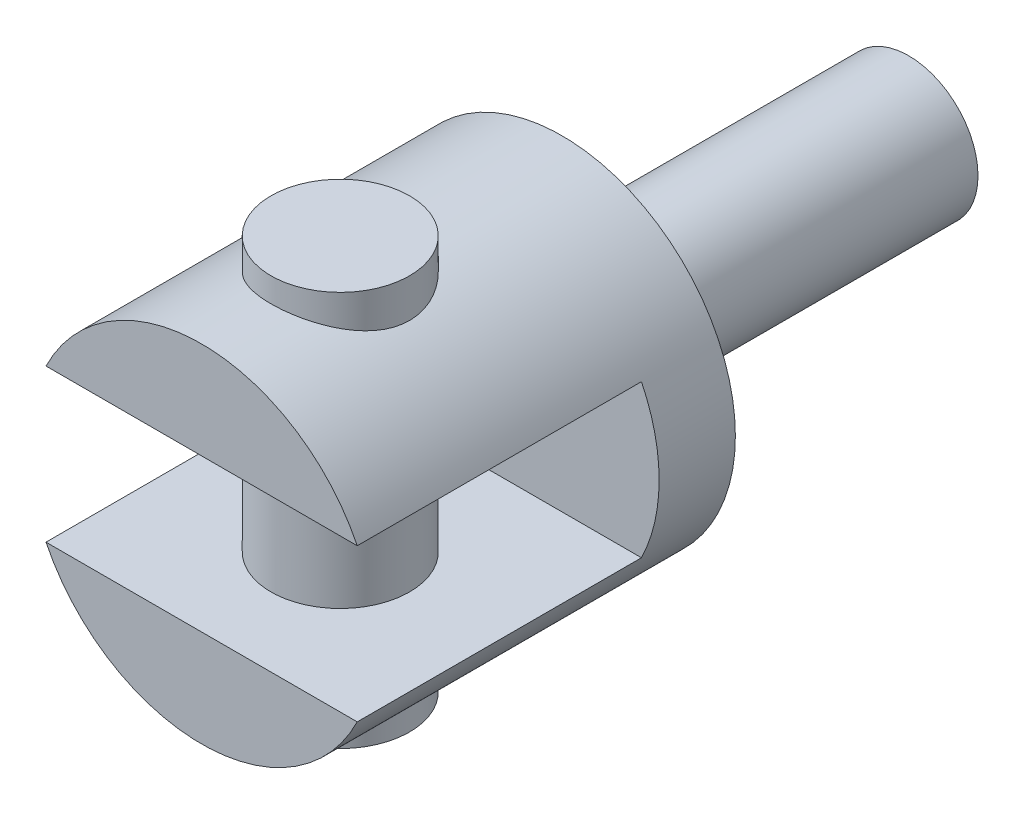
ISO-10303-21;
HEADER;
FILE_DESCRIPTION(('STEP AP214'),'2;1');
FILE_NAME('part.step','',(''),(''),'','','');
FILE_SCHEMA(('AUTOMOTIVE_DESIGN { 1 0 10303 214 1 1 1 1 }'));
ENDSEC;
DATA;
#1=APPLICATION_CONTEXT('core data for automotive mechanical design processes');
#2=APPLICATION_PROTOCOL_DEFINITION('international standard','automotive_design',2000,#1);
#3=PRODUCT_CONTEXT('',#1,'mechanical');
#4=PRODUCT('Part','Part','',(#3));
#5=PRODUCT_RELATED_PRODUCT_CATEGORY('part','',(#4));
#6=PRODUCT_DEFINITION_FORMATION('','',#4);
#7=PRODUCT_DEFINITION_CONTEXT('part definition',#1,'design');
#8=PRODUCT_DEFINITION('design','',#6,#7);
#9=PRODUCT_DEFINITION_SHAPE('','',#8);
#10=(LENGTH_UNIT() NAMED_UNIT(*) SI_UNIT(.MILLI.,.METRE.));
#11=(NAMED_UNIT(*) PLANE_ANGLE_UNIT() SI_UNIT($,.RADIAN.));
#12=(NAMED_UNIT(*) SI_UNIT($,.STERADIAN.) SOLID_ANGLE_UNIT());
#13=UNCERTAINTY_MEASURE_WITH_UNIT(LENGTH_MEASURE(1.E-05),#10,'distance_accuracy_value','');
#14=(GEOMETRIC_REPRESENTATION_CONTEXT(3) GLOBAL_UNCERTAINTY_ASSIGNED_CONTEXT((#13)) GLOBAL_UNIT_ASSIGNED_CONTEXT((#10,
#11,#12)) REPRESENTATION_CONTEXT('',''));
#15=CARTESIAN_POINT('',(0.,0.,0.));
#16=DIRECTION('',(0.,0.,1.));
#17=DIRECTION('',(1.,0.,0.));
#18=AXIS2_PLACEMENT_3D('',#15,#16,#17);
#19=CARTESIAN_POINT('',(0.,0.,52.));
#20=DIRECTION('',(0.,0.,1.));
#21=DIRECTION('',(1.,0.,0.));
#22=AXIS2_PLACEMENT_3D('',#19,#20,#21);
#23=PLANE('',#22);
#24=DIRECTION('',(1.,0.,0.));
#25=VECTOR('',#24,1.);
#26=CARTESIAN_POINT('',(0.,-11.,52.));
#27=LINE('',#26,#25);
#28=CARTESIAN_POINT('',(-22.4499443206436,-11.,52.));
#29=VERTEX_POINT('',#28);
#30=CARTESIAN_POINT('',(22.4499443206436,-11.,52.));
#31=VERTEX_POINT('',#30);
#32=EDGE_CURVE('E39',#29,#31,#27,.T.);
#33=ORIENTED_EDGE('',*,*,#32,.F.);
#34=CARTESIAN_POINT('',(0.,0.,52.));
#35=DIRECTION('',(0.,0.,1.));
#36=DIRECTION('',(1.,0.,0.));
#37=AXIS2_PLACEMENT_3D('',#34,#35,#36);
#38=CIRCLE('',#37,25.);
#39=EDGE_CURVE('E83',#29,#31,#38,.T.);
#40=ORIENTED_EDGE('',*,*,#39,.T.);
#41=EDGE_LOOP('',(#33,#40));
#42=FACE_BOUND('',#41,.T.);
#43=ADVANCED_FACE('F14',(#42),#23,.T.);
#44=DIRECTION('',(-1.,0.,0.));
#45=VECTOR('',#44,1.);
#46=CARTESIAN_POINT('',(0.,11.,52.));
#47=LINE('',#46,#45);
#48=CARTESIAN_POINT('',(22.4499443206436,11.,52.));
#49=VERTEX_POINT('',#48);
#50=CARTESIAN_POINT('',(-22.4499443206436,11.,52.));
#51=VERTEX_POINT('',#50);
#52=EDGE_CURVE('E59',#49,#51,#47,.T.);
#53=ORIENTED_EDGE('',*,*,#52,.F.);
#54=EDGE_CURVE('E81',#49,#51,#38,.T.);
#55=ORIENTED_EDGE('',*,*,#54,.T.);
#56=EDGE_LOOP('',(#53,#55));
#57=FACE_BOUND('',#56,.T.);
#58=ADVANCED_FACE('F16',(#57),#23,.T.);
#59=CARTESIAN_POINT('',(0.,0.,30.));
#60=DIRECTION('',(0.,0.,1.));
#61=DIRECTION('',(1.,0.,0.));
#62=AXIS2_PLACEMENT_3D('',#59,#60,#61);
#63=CYLINDRICAL_SURFACE('',#62,25.);
#64=CARTESIAN_POINT('',(0.,25.,22.));
#65=CARTESIAN_POINT('',(-0.268856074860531,24.9999987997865,22.0000015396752));
#66=CARTESIAN_POINT('',(-0.537815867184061,24.9956509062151,22.0108574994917));
#67=CARTESIAN_POINT('',(-1.07383269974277,24.9783682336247,22.0541835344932));
#68=CARTESIAN_POINT('',(-1.3408883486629,24.9654277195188,22.086668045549));
#69=CARTESIAN_POINT('',(-1.87162915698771,24.9312628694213,22.1730246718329));
#70=CARTESIAN_POINT('',(-2.13530505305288,24.9100193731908,22.2269462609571));
#71=CARTESIAN_POINT('',(-2.6567730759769,24.8598107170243,22.355639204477));
#72=CARTESIAN_POINT('',(-2.91456479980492,24.8308450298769,22.4304119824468));
#73=CARTESIAN_POINT('',(-3.42166104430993,24.7660524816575,22.5998161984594));
#74=CARTESIAN_POINT('',(-3.67099125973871,24.7302490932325,22.6943798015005));
#75=CARTESIAN_POINT('',(-4.16052228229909,24.6526163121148,22.9027020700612));
#76=CARTESIAN_POINT('',(-4.40072273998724,24.6107866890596,23.0164614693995));
#77=CARTESIAN_POINT('',(-4.87046113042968,24.5221467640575,23.2622194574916));
#78=CARTESIAN_POINT('',(-5.10000543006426,24.4753394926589,23.3942069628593));
#79=CARTESIAN_POINT('',(-5.54736801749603,24.3778429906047,23.6755408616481));
#80=CARTESIAN_POINT('',(-5.76518197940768,24.3271523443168,23.8248935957));
#81=CARTESIAN_POINT('',(-6.41724383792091,24.1665964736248,24.3109983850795));
#82=CARTESIAN_POINT('',(-6.83020129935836,24.0521426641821,24.6754141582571));
#83=CARTESIAN_POINT('',(-7.59098514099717,23.8230010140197,25.4671191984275));
#84=CARTESIAN_POINT('',(-7.93877965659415,23.7083130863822,25.8944390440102));
#85=CARTESIAN_POINT('',(-8.41206275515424,23.5428728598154,26.585207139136));
#86=CARTESIAN_POINT('',(-8.5644417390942,23.4877248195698,26.8295584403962));
#87=CARTESIAN_POINT('',(-8.84793241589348,23.3824066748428,27.331273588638));
#88=CARTESIAN_POINT('',(-8.97905285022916,23.3322345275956,27.5886320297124));
#89=CARTESIAN_POINT('',(-9.21889182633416,23.2385160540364,28.1146933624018));
#90=CARTESIAN_POINT('',(-9.32761371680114,23.194968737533,28.3833945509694));
#91=CARTESIAN_POINT('',(-9.52161114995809,23.1160096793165,28.9302969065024));
#92=CARTESIAN_POINT('',(-9.60688828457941,23.0805973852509,29.2084974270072));
#93=CARTESIAN_POINT('',(-9.74973528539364,23.0206079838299,29.7594753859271));
#94=CARTESIAN_POINT('',(-9.80838572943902,22.9956125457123,30.0319271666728));
#95=CARTESIAN_POINT('',(-9.90280197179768,22.9551119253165,30.5814699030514));
#96=CARTESIAN_POINT('',(-9.93856842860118,22.9396064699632,30.8585607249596));
#97=CARTESIAN_POINT('',(-9.98677972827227,22.9186588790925,31.4150265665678));
#98=CARTESIAN_POINT('',(-9.99923443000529,22.9132124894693,31.6944005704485));
#99=CARTESIAN_POINT('',(-10.0006969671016,22.9125744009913,32.2532151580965));
#100=CARTESIAN_POINT('',(-9.98970589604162,22.9173822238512,32.5326557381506));
#101=CARTESIAN_POINT('',(-9.94600313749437,22.9363800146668,33.0698060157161));
#102=CARTESIAN_POINT('',(-9.91486313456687,22.9498908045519,33.327669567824));
#103=CARTESIAN_POINT('',(-9.8327336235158,22.9851984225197,33.8397303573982));
#104=CARTESIAN_POINT('',(-9.781737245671,23.0069981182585,34.0939262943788));
#105=CARTESIAN_POINT('',(-9.66041020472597,23.0582046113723,34.5967988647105));
#106=CARTESIAN_POINT('',(-9.59008442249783,23.0876094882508,34.8454768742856));
#107=CARTESIAN_POINT('',(-9.43069714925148,23.1531719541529,35.3359362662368));
#108=CARTESIAN_POINT('',(-9.34162833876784,23.1893321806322,35.5777149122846));
#109=CARTESIAN_POINT('',(-9.14353943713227,23.2681599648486,36.057636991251));
#110=CARTESIAN_POINT('',(-9.03415671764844,23.3109429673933,36.2956116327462));
#111=CARTESIAN_POINT('',(-8.79745135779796,23.4013011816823,36.7616370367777));
#112=CARTESIAN_POINT('',(-8.67012091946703,23.4488784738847,36.9896834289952));
#113=CARTESIAN_POINT('',(-8.39840118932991,23.5475634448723,37.434593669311));
#114=CARTESIAN_POINT('',(-8.25401043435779,23.5986714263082,37.6514565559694));
#115=CARTESIAN_POINT('',(-7.94904534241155,23.7031359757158,38.0729190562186));
#116=CARTESIAN_POINT('',(-7.78847017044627,23.7564926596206,38.277518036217));
#117=CARTESIAN_POINT('',(-7.43895922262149,23.8683493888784,38.6888152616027));
#118=CARTESIAN_POINT('',(-7.24878974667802,23.9269273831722,38.8944455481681));
#119=CARTESIAN_POINT('',(-6.85187633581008,24.0435970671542,39.2890383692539));
#120=CARTESIAN_POINT('',(-6.64513775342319,24.1016889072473,39.4780062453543));
#121=CARTESIAN_POINT('',(-6.21608047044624,24.2158965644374,39.8382944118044));
#122=CARTESIAN_POINT('',(-5.99375264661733,24.2720111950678,40.0096042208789));
#123=CARTESIAN_POINT('',(-5.53499341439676,24.3807175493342,40.3332233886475));
#124=CARTESIAN_POINT('',(-5.29856771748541,24.4333106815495,40.4855403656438));
#125=CARTESIAN_POINT('',(-4.80805882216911,24.5345984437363,40.7729685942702));
#126=CARTESIAN_POINT('',(-4.55371661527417,24.5831937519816,40.9076735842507));
#127=CARTESIAN_POINT('',(-4.03339771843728,24.6739018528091,41.1550357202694));
#128=CARTESIAN_POINT('',(-3.76742076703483,24.7160144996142,41.267692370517));
#129=CARTESIAN_POINT('',(-3.22583634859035,24.7925136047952,41.4698196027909));
#130=CARTESIAN_POINT('',(-2.95023288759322,24.8269032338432,41.5592997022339));
#131=CARTESIAN_POINT('',(-2.39141303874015,24.8869461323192,41.7141747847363));
#132=CARTESIAN_POINT('',(-2.10819717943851,24.912600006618,41.7795714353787));
#133=CARTESIAN_POINT('',(-1.55340742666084,24.9531491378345,41.8823955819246));
#134=CARTESIAN_POINT('',(-1.28213731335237,24.9685915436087,41.9212500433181));
#135=CARTESIAN_POINT('',(-0.736968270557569,24.9906239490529,41.9765692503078));
#136=CARTESIAN_POINT('',(-0.463069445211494,24.9972142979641,41.9930348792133));
#137=CARTESIAN_POINT('',(0.0851598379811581,25.0013575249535,42.0033944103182));
#138=CARTESIAN_POINT('',(0.359490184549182,24.9989124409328,41.9972934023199));
#139=CARTESIAN_POINT('',(0.906492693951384,24.9850578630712,41.9625985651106));
#140=CARTESIAN_POINT('',(1.17916488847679,24.9736485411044,41.9340051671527));
#141=CARTESIAN_POINT('',(1.70854732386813,24.9428944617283,41.8564286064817));
#142=CARTESIAN_POINT('',(1.96542355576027,24.923930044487,41.8084212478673));
#143=CARTESIAN_POINT('',(2.47400175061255,24.8785950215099,41.6926429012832));
#144=CARTESIAN_POINT('',(2.72570390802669,24.8522246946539,41.6248726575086));
#145=CARTESIAN_POINT('',(3.22229813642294,24.7927274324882,41.4701861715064));
#146=CARTESIAN_POINT('',(3.46719085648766,24.7596011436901,41.3832717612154));
#147=CARTESIAN_POINT('',(3.9488064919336,24.6873702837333,41.1909841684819));
#148=CARTESIAN_POINT('',(4.18552624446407,24.6482634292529,41.085603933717));
#149=CARTESIAN_POINT('',(4.65637431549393,24.5637355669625,40.8537621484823));
#150=CARTESIAN_POINT('',(4.89020861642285,24.5181595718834,40.7267601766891));
#151=CARTESIAN_POINT('',(5.34646626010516,24.4227281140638,40.4549302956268));
#152=CARTESIAN_POINT('',(5.5688853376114,24.3728710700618,40.3100957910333));
#153=CARTESIAN_POINT('',(6.00108282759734,24.2700712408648,40.0035744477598));
#154=CARTESIAN_POINT('',(6.21085927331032,24.2171279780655,39.8418849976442));
#155=CARTESIAN_POINT('',(6.61666901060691,24.1094125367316,39.5026423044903));
#156=CARTESIAN_POINT('',(6.81270170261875,24.0546402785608,39.3250883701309));
#157=CARTESIAN_POINT('',(7.20254295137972,23.9409125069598,38.9428205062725));
#158=CARTESIAN_POINT('',(7.39534176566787,23.8819204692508,38.7370862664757));
#159=CARTESIAN_POINT('',(7.76293857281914,23.7649738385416,38.3100029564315));
#160=CARTESIAN_POINT('',(7.93774396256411,23.7070188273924,38.0886603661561));
#161=CARTESIAN_POINT('',(8.26843059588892,23.593720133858,37.6314038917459));
#162=CARTESIAN_POINT('',(8.4242999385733,23.538378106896,37.3954809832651));
#163=CARTESIAN_POINT('',(8.71581171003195,23.4320016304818,36.9106614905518));
#164=CARTESIAN_POINT('',(8.85146276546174,23.3809653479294,36.6617705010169));
#165=CARTESIAN_POINT('',(9.10280639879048,23.2842703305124,36.1498256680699));
#166=CARTESIAN_POINT('',(9.21828055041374,23.238671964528,35.8866529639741));
#167=CARTESIAN_POINT('',(9.42642443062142,23.1550234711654,35.3504028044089));
#168=CARTESIAN_POINT('',(9.51910450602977,23.1169699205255,35.0773299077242));
#169=CARTESIAN_POINT('',(9.68071804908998,23.0497585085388,34.5232784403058));
#170=CARTESIAN_POINT('',(9.74966062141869,23.0205972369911,34.2423029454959));
#171=CARTESIAN_POINT('',(9.86303416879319,22.9722522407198,33.6746094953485));
#172=CARTESIAN_POINT('',(9.90746719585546,22.9530676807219,33.3878920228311));
#173=CARTESIAN_POINT('',(9.96896941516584,22.9264187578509,32.8319507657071));
#174=CARTESIAN_POINT('',(9.98777855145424,22.9182099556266,32.5629538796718));
#175=CARTESIAN_POINT('',(10.0036007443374,22.9113084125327,32.024203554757));
#176=CARTESIAN_POINT('',(10.0006148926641,22.9126151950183,31.7544501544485));
#177=CARTESIAN_POINT('',(9.97288442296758,22.924698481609,31.2163146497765));
#178=CARTESIAN_POINT('',(9.94814236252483,22.9354738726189,30.9479323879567));
#179=CARTESIAN_POINT('',(9.87718285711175,22.9661217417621,30.4145536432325));
#180=CARTESIAN_POINT('',(9.83096551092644,22.9859941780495,30.1495571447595));
#181=CARTESIAN_POINT('',(9.71981602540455,23.0332077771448,29.6353444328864));
#182=CARTESIAN_POINT('',(9.65570270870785,23.0602198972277,29.3859201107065));
#183=CARTESIAN_POINT('',(9.50870278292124,23.1212218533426,28.8934538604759));
#184=CARTESIAN_POINT('',(9.42580965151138,23.1552141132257,28.6504141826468));
#185=CARTESIAN_POINT('',(9.24195624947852,23.2292069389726,28.1722244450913));
#186=CARTESIAN_POINT('',(9.14099605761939,23.2692074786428,27.9370743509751));
#187=CARTESIAN_POINT('',(8.92175817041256,23.354144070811,27.4759058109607));
#188=CARTESIAN_POINT('',(8.80347897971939,23.3990805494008,27.2498881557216));
#189=CARTESIAN_POINT('',(8.54314954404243,23.4954237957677,26.7954802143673));
#190=CARTESIAN_POINT('',(8.40012626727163,23.5470536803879,26.5676944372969));
#191=CARTESIAN_POINT('',(8.09656015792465,23.6531511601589,26.1248152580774));
#192=CARTESIAN_POINT('',(7.93601678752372,23.7076188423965,25.909722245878));
#193=CARTESIAN_POINT('',(7.59832768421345,23.817996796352,25.4932883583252));
#194=CARTESIAN_POINT('',(7.42117756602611,23.873907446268,25.2919511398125));
#195=CARTESIAN_POINT('',(7.05129496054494,23.9857576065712,24.9041530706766));
#196=CARTESIAN_POINT('',(6.85856242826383,24.0416971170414,24.7176922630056));
#197=CARTESIAN_POINT('',(6.44548479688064,24.1558392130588,24.3490351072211));
#198=CARTESIAN_POINT('',(6.22415880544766,24.2139518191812,24.1679079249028));
#199=CARTESIAN_POINT('',(5.76636554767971,24.3270342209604,23.824989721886));
#200=CARTESIAN_POINT('',(5.52990337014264,24.3820050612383,23.6631922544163));
#201=CARTESIAN_POINT('',(5.0430252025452,24.4873430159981,23.3599652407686));
#202=CARTESIAN_POINT('',(4.79259907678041,24.5377067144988,23.2185507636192));
#203=CARTESIAN_POINT('',(4.27958410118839,24.6323603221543,22.9574347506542));
#204=CARTESIAN_POINT('',(4.01699627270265,24.6766507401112,22.8377313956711));
#205=CARTESIAN_POINT('',(3.48641938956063,24.757131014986,22.6231536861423));
#206=CARTESIAN_POINT('',(3.21862009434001,24.7934555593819,22.5278610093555));
#207=CARTESIAN_POINT('',(2.67499006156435,24.8579830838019,22.3602223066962));
#208=CARTESIAN_POINT('',(2.39916010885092,24.8861868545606,22.2878740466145));
#209=CARTESIAN_POINT('',(1.84235798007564,24.9335835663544,22.1670620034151));
#210=CARTESIAN_POINT('',(1.56140180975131,24.9528007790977,22.1185338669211));
#211=CARTESIAN_POINT('',(0.996030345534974,24.9817517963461,22.0456515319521));
#212=CARTESIAN_POINT('',(0.711617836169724,24.9914927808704,22.0212790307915));
#213=CARTESIAN_POINT('',(0.355650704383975,24.9975715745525,22.0060726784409));
#214=CARTESIAN_POINT('',(0.284544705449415,24.9984818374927,22.0037959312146));
#215=CARTESIAN_POINT('',(0.142294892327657,24.9996962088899,22.0007593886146));
#216=CARTESIAN_POINT('',(0.0711510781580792,25.000000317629,21.9999995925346));
#217=CARTESIAN_POINT('',(0.,25.,22.));
#218=B_SPLINE_CURVE_WITH_KNOTS('',3,(#64,#65,#66,#67,#68,#69,#70,#71,#72,#73,#74,#75,#76,#77,
#78,#79,#80,#81,#82,#83,#84,#85,#86,#87,#88,#89,#90,#91,#92,#93,#94,#95,#96,#97,#98,#99,#100,
#101,#102,#103,#104,#105,#106,#107,#108,#109,#110,#111,#112,#113,#114,#115,#116,#117,#118,#119,
#120,#121,#122,#123,#124,#125,#126,#127,#128,#129,#130,#131,#132,#133,#134,#135,#136,#137,#138,
#139,#140,#141,#142,#143,#144,#145,#146,#147,#148,#149,#150,#151,#152,#153,#154,#155,#156,#157,
#158,#159,#160,#161,#162,#163,#164,#165,#166,#167,#168,#169,#170,#171,#172,#173,#174,#175,#176,
#177,#178,#179,#180,#181,#182,#183,#184,#185,#186,#187,#188,#189,#190,#191,#192,#193,#194,#195,
#196,#197,#198,#199,#200,#201,#202,#203,#204,#205,#206,#207,#208,#209,#210,#211,#212,#213,#214,
#215,#216,#217),.UNSPECIFIED.,.T.,.F.,(4,2,2,2,2,2,2,2,2,2,2,2,2,2,2,2,2,2,2,2,2,2,2,2,2,2,2,2,
2,2,2,2,2,2,2,2,2,2,2,2,2,2,2,2,2,2,2,2,2,2,2,2,2,2,2,2,2,2,2,2,2,2,2,2,2,2,2,2,2,2,2,2,2,2,2,2,
4),(0.,0.806495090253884,1.61352901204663,2.42243637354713,3.23139897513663,4.03763290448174,
4.84389766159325,5.64967431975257,6.45574612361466,8.13547753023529,9.81602819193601,
10.694707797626,11.5730251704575,12.4512111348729,13.3293374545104,14.1676655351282,
15.0059694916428,15.8439188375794,16.681829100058,17.4611798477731,18.2408004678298,
19.0202244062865,19.7999532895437,20.5952401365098,21.390873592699,22.1865753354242,
22.9823181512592,23.8397788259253,24.6969636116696,25.5546543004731,26.4119998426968,
27.2865371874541,28.1610941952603,29.0352914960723,29.9094282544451,30.7317995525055,
31.5541384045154,32.3762917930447,33.1984294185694,33.983557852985,34.7686567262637,
35.5536805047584,36.3390047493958,37.148039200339,37.9573737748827,38.7668339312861,
39.5763293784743,40.4395111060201,41.3023365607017,42.1657015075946,43.028697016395,
43.9005230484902,44.7719526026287,45.6430475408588,46.5140695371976,47.3223742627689,
48.1306384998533,48.9388077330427,49.7469732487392,50.5229462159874,51.2991890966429,
52.0754285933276,52.8517351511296,53.6724705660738,54.4932311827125,55.3142091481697,
56.1351894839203,57.0096537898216,57.8838256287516,58.7586404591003,59.6333819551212,
60.4919426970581,61.3504198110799,62.2065646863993,63.0620603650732,63.2754943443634,
63.4889282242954),.UNSPECIFIED.);
#219=CARTESIAN_POINT('',(0.,25.,22.));
#220=VERTEX_POINT('',#219);
#221=EDGE_CURVE('E9',#220,#220,#218,.T.);
#222=ORIENTED_EDGE('',*,*,#221,.F.);
#223=EDGE_LOOP('',(#222));
#224=FACE_BOUND('',#223,.T.);
#225=CARTESIAN_POINT('',(0.,-25.,22.));
#226=CARTESIAN_POINT('',(0.268856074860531,-24.9999987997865,22.0000015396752));
#227=CARTESIAN_POINT('',(0.537815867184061,-24.9956509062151,22.0108574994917));
#228=CARTESIAN_POINT('',(1.07383269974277,-24.9783682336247,22.0541835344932));
#229=CARTESIAN_POINT('',(1.3408883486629,-24.9654277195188,22.086668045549));
#230=CARTESIAN_POINT('',(1.87162915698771,-24.9312628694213,22.1730246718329));
#231=CARTESIAN_POINT('',(2.13530505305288,-24.9100193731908,22.2269462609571));
#232=CARTESIAN_POINT('',(2.6567730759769,-24.8598107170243,22.355639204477));
#233=CARTESIAN_POINT('',(2.91456479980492,-24.8308450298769,22.4304119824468));
#234=CARTESIAN_POINT('',(3.42166104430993,-24.7660524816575,22.5998161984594));
#235=CARTESIAN_POINT('',(3.67099125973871,-24.7302490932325,22.6943798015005));
#236=CARTESIAN_POINT('',(4.16052228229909,-24.6526163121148,22.9027020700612));
#237=CARTESIAN_POINT('',(4.40072273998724,-24.6107866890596,23.0164614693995));
#238=CARTESIAN_POINT('',(4.87046113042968,-24.5221467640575,23.2622194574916));
#239=CARTESIAN_POINT('',(5.10000543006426,-24.4753394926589,23.3942069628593));
#240=CARTESIAN_POINT('',(5.54736801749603,-24.3778429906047,23.6755408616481));
#241=CARTESIAN_POINT('',(5.76518197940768,-24.3271523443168,23.8248935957));
#242=CARTESIAN_POINT('',(6.41724383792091,-24.1665964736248,24.3109983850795));
#243=CARTESIAN_POINT('',(6.83020129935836,-24.0521426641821,24.6754141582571));
#244=CARTESIAN_POINT('',(7.59098514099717,-23.8230010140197,25.4671191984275));
#245=CARTESIAN_POINT('',(7.93877965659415,-23.7083130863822,25.8944390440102));
#246=CARTESIAN_POINT('',(8.41206275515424,-23.5428728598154,26.585207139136));
#247=CARTESIAN_POINT('',(8.5644417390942,-23.4877248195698,26.8295584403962));
#248=CARTESIAN_POINT('',(8.84793241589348,-23.3824066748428,27.331273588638));
#249=CARTESIAN_POINT('',(8.97905285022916,-23.3322345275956,27.5886320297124));
#250=CARTESIAN_POINT('',(9.21889182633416,-23.2385160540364,28.1146933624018));
#251=CARTESIAN_POINT('',(9.32761371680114,-23.194968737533,28.3833945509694));
#252=CARTESIAN_POINT('',(9.52161114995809,-23.1160096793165,28.9302969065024));
#253=CARTESIAN_POINT('',(9.60688828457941,-23.0805973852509,29.2084974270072));
#254=CARTESIAN_POINT('',(9.74973528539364,-23.0206079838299,29.7594753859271));
#255=CARTESIAN_POINT('',(9.80838572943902,-22.9956125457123,30.0319271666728));
#256=CARTESIAN_POINT('',(9.90280197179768,-22.9551119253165,30.5814699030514));
#257=CARTESIAN_POINT('',(9.93856842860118,-22.9396064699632,30.8585607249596));
#258=CARTESIAN_POINT('',(9.98677972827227,-22.9186588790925,31.4150265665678));
#259=CARTESIAN_POINT('',(9.99923443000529,-22.9132124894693,31.6944005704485));
#260=CARTESIAN_POINT('',(10.0006969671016,-22.9125744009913,32.2532151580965));
#261=CARTESIAN_POINT('',(9.98970589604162,-22.9173822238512,32.5326557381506));
#262=CARTESIAN_POINT('',(9.94600313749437,-22.9363800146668,33.0698060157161));
#263=CARTESIAN_POINT('',(9.91486313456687,-22.9498908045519,33.327669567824));
#264=CARTESIAN_POINT('',(9.8327336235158,-22.9851984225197,33.8397303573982));
#265=CARTESIAN_POINT('',(9.781737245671,-23.0069981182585,34.0939262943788));
#266=CARTESIAN_POINT('',(9.66041020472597,-23.0582046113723,34.5967988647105));
#267=CARTESIAN_POINT('',(9.59008442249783,-23.0876094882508,34.8454768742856));
#268=CARTESIAN_POINT('',(9.43069714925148,-23.1531719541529,35.3359362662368));
#269=CARTESIAN_POINT('',(9.34162833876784,-23.1893321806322,35.5777149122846));
#270=CARTESIAN_POINT('',(9.14353943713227,-23.2681599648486,36.057636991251));
#271=CARTESIAN_POINT('',(9.03415671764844,-23.3109429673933,36.2956116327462));
#272=CARTESIAN_POINT('',(8.79745135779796,-23.4013011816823,36.7616370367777));
#273=CARTESIAN_POINT('',(8.67012091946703,-23.4488784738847,36.9896834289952));
#274=CARTESIAN_POINT('',(8.39840118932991,-23.5475634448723,37.434593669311));
#275=CARTESIAN_POINT('',(8.25401043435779,-23.5986714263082,37.6514565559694));
#276=CARTESIAN_POINT('',(7.94904534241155,-23.7031359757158,38.0729190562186));
#277=CARTESIAN_POINT('',(7.78847017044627,-23.7564926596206,38.277518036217));
#278=CARTESIAN_POINT('',(7.43895922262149,-23.8683493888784,38.6888152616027));
#279=CARTESIAN_POINT('',(7.24878974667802,-23.9269273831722,38.8944455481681));
#280=CARTESIAN_POINT('',(6.85187633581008,-24.0435970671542,39.2890383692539));
#281=CARTESIAN_POINT('',(6.64513775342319,-24.1016889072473,39.4780062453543));
#282=CARTESIAN_POINT('',(6.21608047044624,-24.2158965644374,39.8382944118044));
#283=CARTESIAN_POINT('',(5.99375264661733,-24.2720111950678,40.0096042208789));
#284=CARTESIAN_POINT('',(5.53499341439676,-24.3807175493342,40.3332233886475));
#285=CARTESIAN_POINT('',(5.29856771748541,-24.4333106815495,40.4855403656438));
#286=CARTESIAN_POINT('',(4.80805882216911,-24.5345984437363,40.7729685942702));
#287=CARTESIAN_POINT('',(4.55371661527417,-24.5831937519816,40.9076735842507));
#288=CARTESIAN_POINT('',(4.03339771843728,-24.6739018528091,41.1550357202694));
#289=CARTESIAN_POINT('',(3.76742076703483,-24.7160144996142,41.267692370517));
#290=CARTESIAN_POINT('',(3.22583634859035,-24.7925136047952,41.4698196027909));
#291=CARTESIAN_POINT('',(2.95023288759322,-24.8269032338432,41.5592997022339));
#292=CARTESIAN_POINT('',(2.39141303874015,-24.8869461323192,41.7141747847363));
#293=CARTESIAN_POINT('',(2.10819717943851,-24.912600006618,41.7795714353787));
#294=CARTESIAN_POINT('',(1.55340742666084,-24.9531491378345,41.8823955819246));
#295=CARTESIAN_POINT('',(1.28213731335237,-24.9685915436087,41.9212500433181));
#296=CARTESIAN_POINT('',(0.736968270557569,-24.9906239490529,41.9765692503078));
#297=CARTESIAN_POINT('',(0.463069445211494,-24.9972142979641,41.9930348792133));
#298=CARTESIAN_POINT('',(-0.0851598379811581,-25.0013575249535,42.0033944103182));
#299=CARTESIAN_POINT('',(-0.359490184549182,-24.9989124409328,41.9972934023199));
#300=CARTESIAN_POINT('',(-0.906492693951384,-24.9850578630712,41.9625985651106));
#301=CARTESIAN_POINT('',(-1.17916488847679,-24.9736485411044,41.9340051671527));
#302=CARTESIAN_POINT('',(-1.70854732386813,-24.9428944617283,41.8564286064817));
#303=CARTESIAN_POINT('',(-1.96542355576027,-24.923930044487,41.8084212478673));
#304=CARTESIAN_POINT('',(-2.47400175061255,-24.8785950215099,41.6926429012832));
#305=CARTESIAN_POINT('',(-2.72570390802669,-24.8522246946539,41.6248726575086));
#306=CARTESIAN_POINT('',(-3.22229813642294,-24.7927274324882,41.4701861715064));
#307=CARTESIAN_POINT('',(-3.46719085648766,-24.7596011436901,41.3832717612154));
#308=CARTESIAN_POINT('',(-3.9488064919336,-24.6873702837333,41.1909841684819));
#309=CARTESIAN_POINT('',(-4.18552624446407,-24.6482634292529,41.085603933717));
#310=CARTESIAN_POINT('',(-4.65637431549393,-24.5637355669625,40.8537621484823));
#311=CARTESIAN_POINT('',(-4.89020861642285,-24.5181595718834,40.7267601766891));
#312=CARTESIAN_POINT('',(-5.34646626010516,-24.4227281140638,40.4549302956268));
#313=CARTESIAN_POINT('',(-5.5688853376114,-24.3728710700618,40.3100957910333));
#314=CARTESIAN_POINT('',(-6.00108282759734,-24.2700712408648,40.0035744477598));
#315=CARTESIAN_POINT('',(-6.21085927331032,-24.2171279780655,39.8418849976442));
#316=CARTESIAN_POINT('',(-6.61666901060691,-24.1094125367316,39.5026423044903));
#317=CARTESIAN_POINT('',(-6.81270170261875,-24.0546402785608,39.3250883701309));
#318=CARTESIAN_POINT('',(-7.20254295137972,-23.9409125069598,38.9428205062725));
#319=CARTESIAN_POINT('',(-7.39534176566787,-23.8819204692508,38.7370862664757));
#320=CARTESIAN_POINT('',(-7.76293857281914,-23.7649738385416,38.3100029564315));
#321=CARTESIAN_POINT('',(-7.93774396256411,-23.7070188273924,38.0886603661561));
#322=CARTESIAN_POINT('',(-8.26843059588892,-23.593720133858,37.6314038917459));
#323=CARTESIAN_POINT('',(-8.4242999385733,-23.538378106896,37.3954809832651));
#324=CARTESIAN_POINT('',(-8.71581171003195,-23.4320016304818,36.9106614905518));
#325=CARTESIAN_POINT('',(-8.85146276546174,-23.3809653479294,36.6617705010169));
#326=CARTESIAN_POINT('',(-9.10280639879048,-23.2842703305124,36.1498256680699));
#327=CARTESIAN_POINT('',(-9.21828055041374,-23.238671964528,35.8866529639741));
#328=CARTESIAN_POINT('',(-9.42642443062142,-23.1550234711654,35.3504028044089));
#329=CARTESIAN_POINT('',(-9.51910450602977,-23.1169699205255,35.0773299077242));
#330=CARTESIAN_POINT('',(-9.68071804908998,-23.0497585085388,34.5232784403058));
#331=CARTESIAN_POINT('',(-9.74966062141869,-23.0205972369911,34.2423029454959));
#332=CARTESIAN_POINT('',(-9.86303416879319,-22.9722522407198,33.6746094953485));
#333=CARTESIAN_POINT('',(-9.90746719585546,-22.9530676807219,33.3878920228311));
#334=CARTESIAN_POINT('',(-9.96896941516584,-22.9264187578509,32.8319507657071));
#335=CARTESIAN_POINT('',(-9.98777855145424,-22.9182099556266,32.5629538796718));
#336=CARTESIAN_POINT('',(-10.0036007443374,-22.9113084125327,32.024203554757));
#337=CARTESIAN_POINT('',(-10.0006148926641,-22.9126151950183,31.7544501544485));
#338=CARTESIAN_POINT('',(-9.97288442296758,-22.924698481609,31.2163146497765));
#339=CARTESIAN_POINT('',(-9.94814236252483,-22.9354738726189,30.9479323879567));
#340=CARTESIAN_POINT('',(-9.87718285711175,-22.9661217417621,30.4145536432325));
#341=CARTESIAN_POINT('',(-9.83096551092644,-22.9859941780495,30.1495571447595));
#342=CARTESIAN_POINT('',(-9.71981602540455,-23.0332077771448,29.6353444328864));
#343=CARTESIAN_POINT('',(-9.65570270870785,-23.0602198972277,29.3859201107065));
#344=CARTESIAN_POINT('',(-9.50870278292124,-23.1212218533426,28.8934538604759));
#345=CARTESIAN_POINT('',(-9.42580965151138,-23.1552141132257,28.6504141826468));
#346=CARTESIAN_POINT('',(-9.24195624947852,-23.2292069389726,28.1722244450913));
#347=CARTESIAN_POINT('',(-9.14099605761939,-23.2692074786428,27.9370743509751));
#348=CARTESIAN_POINT('',(-8.92175817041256,-23.354144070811,27.4759058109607));
#349=CARTESIAN_POINT('',(-8.80347897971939,-23.3990805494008,27.2498881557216));
#350=CARTESIAN_POINT('',(-8.54314954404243,-23.4954237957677,26.7954802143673));
#351=CARTESIAN_POINT('',(-8.40012626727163,-23.5470536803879,26.5676944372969));
#352=CARTESIAN_POINT('',(-8.09656015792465,-23.6531511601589,26.1248152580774));
#353=CARTESIAN_POINT('',(-7.93601678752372,-23.7076188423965,25.909722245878));
#354=CARTESIAN_POINT('',(-7.59832768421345,-23.817996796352,25.4932883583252));
#355=CARTESIAN_POINT('',(-7.42117756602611,-23.873907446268,25.2919511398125));
#356=CARTESIAN_POINT('',(-7.05129496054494,-23.9857576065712,24.9041530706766));
#357=CARTESIAN_POINT('',(-6.85856242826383,-24.0416971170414,24.7176922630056));
#358=CARTESIAN_POINT('',(-6.44548479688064,-24.1558392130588,24.3490351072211));
#359=CARTESIAN_POINT('',(-6.22415880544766,-24.2139518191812,24.1679079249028));
#360=CARTESIAN_POINT('',(-5.76636554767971,-24.3270342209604,23.824989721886));
#361=CARTESIAN_POINT('',(-5.52990337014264,-24.3820050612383,23.6631922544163));
#362=CARTESIAN_POINT('',(-5.0430252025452,-24.4873430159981,23.3599652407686));
#363=CARTESIAN_POINT('',(-4.79259907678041,-24.5377067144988,23.2185507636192));
#364=CARTESIAN_POINT('',(-4.27958410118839,-24.6323603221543,22.9574347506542));
#365=CARTESIAN_POINT('',(-4.01699627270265,-24.6766507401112,22.8377313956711));
#366=CARTESIAN_POINT('',(-3.48641938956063,-24.757131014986,22.6231536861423));
#367=CARTESIAN_POINT('',(-3.21862009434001,-24.7934555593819,22.5278610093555));
#368=CARTESIAN_POINT('',(-2.67499006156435,-24.8579830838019,22.3602223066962));
#369=CARTESIAN_POINT('',(-2.39916010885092,-24.8861868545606,22.2878740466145));
#370=CARTESIAN_POINT('',(-1.84235798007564,-24.9335835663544,22.1670620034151));
#371=CARTESIAN_POINT('',(-1.56140180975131,-24.9528007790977,22.1185338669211));
#372=CARTESIAN_POINT('',(-0.996030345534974,-24.9817517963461,22.0456515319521));
#373=CARTESIAN_POINT('',(-0.711617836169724,-24.9914927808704,22.0212790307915));
#374=CARTESIAN_POINT('',(-0.355650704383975,-24.9975715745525,22.0060726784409));
#375=CARTESIAN_POINT('',(-0.284544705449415,-24.9984818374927,22.0037959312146));
#376=CARTESIAN_POINT('',(-0.142294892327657,-24.9996962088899,22.0007593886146));
#377=CARTESIAN_POINT('',(-0.0711510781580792,-25.000000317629,21.9999995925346));
#378=CARTESIAN_POINT('',(0.,-25.,22.));
#379=B_SPLINE_CURVE_WITH_KNOTS('',3,(#225,#226,#227,#228,#229,#230,#231,#232,#233,#234,#235,
#236,#237,#238,#239,#240,#241,#242,#243,#244,#245,#246,#247,#248,#249,#250,#251,#252,#253,#254,
#255,#256,#257,#258,#259,#260,#261,#262,#263,#264,#265,#266,#267,#268,#269,#270,#271,#272,#273,
#274,#275,#276,#277,#278,#279,#280,#281,#282,#283,#284,#285,#286,#287,#288,#289,#290,#291,#292,
#293,#294,#295,#296,#297,#298,#299,#300,#301,#302,#303,#304,#305,#306,#307,#308,#309,#310,#311,
#312,#313,#314,#315,#316,#317,#318,#319,#320,#321,#322,#323,#324,#325,#326,#327,#328,#329,#330,
#331,#332,#333,#334,#335,#336,#337,#338,#339,#340,#341,#342,#343,#344,#345,#346,#347,#348,#349,
#350,#351,#352,#353,#354,#355,#356,#357,#358,#359,#360,#361,#362,#363,#364,#365,#366,#367,#368,
#369,#370,#371,#372,#373,#374,#375,#376,#377,#378),.UNSPECIFIED.,.T.,.F.,(4,2,2,2,2,2,2,2,2,2,2,
2,2,2,2,2,2,2,2,2,2,2,2,2,2,2,2,2,2,2,2,2,2,2,2,2,2,2,2,2,2,2,2,2,2,2,2,2,2,2,2,2,2,2,2,2,2,2,2,
2,2,2,2,2,2,2,2,2,2,2,2,2,2,2,2,2,4),(0.,0.806495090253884,1.61352901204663,2.42243637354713,
3.23139897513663,4.03763290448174,4.84389766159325,5.64967431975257,6.45574612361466,
8.13547753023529,9.81602819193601,10.694707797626,11.5730251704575,12.4512111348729,
13.3293374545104,14.1676655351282,15.0059694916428,15.8439188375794,16.681829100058,
17.4611798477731,18.2408004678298,19.0202244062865,19.7999532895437,20.5952401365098,
21.390873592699,22.1865753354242,22.9823181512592,23.8397788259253,24.6969636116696,
25.5546543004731,26.4119998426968,27.2865371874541,28.1610941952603,29.0352914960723,
29.9094282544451,30.7317995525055,31.5541384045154,32.3762917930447,33.1984294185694,
33.983557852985,34.7686567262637,35.5536805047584,36.3390047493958,37.148039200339,
37.9573737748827,38.7668339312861,39.5763293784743,40.4395111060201,41.3023365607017,
42.1657015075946,43.028697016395,43.9005230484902,44.7719526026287,45.6430475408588,
46.5140695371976,47.3223742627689,48.1306384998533,48.9388077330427,49.7469732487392,
50.5229462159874,51.2991890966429,52.0754285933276,52.8517351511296,53.6724705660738,
54.4932311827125,55.3142091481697,56.1351894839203,57.0096537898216,57.8838256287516,
58.7586404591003,59.6333819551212,60.4919426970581,61.3504198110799,62.2065646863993,
63.0620603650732,63.2754943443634,63.4889282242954),.UNSPECIFIED.);
#380=CARTESIAN_POINT('',(0.,-25.,22.));
#381=VERTEX_POINT('',#380);
#382=EDGE_CURVE('E23',#381,#381,#379,.T.);
#383=ORIENTED_EDGE('',*,*,#382,.F.);
#384=EDGE_LOOP('',(#383));
#385=FACE_BOUND('',#384,.T.);
#386=DIRECTION('',(0.,0.,1.));
#387=VECTOR('',#386,1.);
#388=CARTESIAN_POINT('',(-22.4499443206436,-11.,30.));
#389=LINE('',#388,#387);
#390=CARTESIAN_POINT('',(-22.4499443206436,-11.,11.));
#391=VERTEX_POINT('',#390);
#392=EDGE_CURVE('E80',#391,#29,#389,.T.);
#393=ORIENTED_EDGE('',*,*,#392,.F.);
#394=CARTESIAN_POINT('',(0.,0.,11.));
#395=DIRECTION('',(0.,0.,-1.));
#396=DIRECTION('',(-1.,0.,0.));
#397=AXIS2_PLACEMENT_3D('',#394,#395,#396);
#398=CIRCLE('',#397,25.);
#399=CARTESIAN_POINT('',(-22.4499443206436,11.,11.));
#400=VERTEX_POINT('',#399);
#401=EDGE_CURVE('E65',#400,#391,#398,.F.);
#402=ORIENTED_EDGE('',*,*,#401,.F.);
#403=DIRECTION('',(0.,0.,1.));
#404=VECTOR('',#403,1.);
#405=CARTESIAN_POINT('',(-22.4499443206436,11.,30.));
#406=LINE('',#405,#404);
#407=EDGE_CURVE('E56',#51,#400,#406,.F.);
#408=ORIENTED_EDGE('',*,*,#407,.F.);
#409=ORIENTED_EDGE('',*,*,#54,.F.);
#410=DIRECTION('',(0.,0.,1.));
#411=VECTOR('',#410,1.);
#412=CARTESIAN_POINT('',(22.4499443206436,11.,30.));
#413=LINE('',#412,#411);
#414=CARTESIAN_POINT('',(22.4499443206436,11.,11.));
#415=VERTEX_POINT('',#414);
#416=EDGE_CURVE('E64',#415,#49,#413,.T.);
#417=ORIENTED_EDGE('',*,*,#416,.F.);
#418=CARTESIAN_POINT('',(22.4499443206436,-11.,11.));
#419=VERTEX_POINT('',#418);
#420=EDGE_CURVE('E71',#419,#415,#398,.F.);
#421=ORIENTED_EDGE('',*,*,#420,.F.);
#422=DIRECTION('',(0.,0.,1.));
#423=VECTOR('',#422,1.);
#424=CARTESIAN_POINT('',(22.4499443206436,-11.,30.));
#425=LINE('',#424,#423);
#426=EDGE_CURVE('E85',#31,#419,#425,.F.);
#427=ORIENTED_EDGE('',*,*,#426,.F.);
#428=ORIENTED_EDGE('',*,*,#39,.F.);
#429=EDGE_LOOP('',(#393,#402,#408,#409,#417,#421,#427,#428));
#430=FACE_BOUND('',#429,.T.);
#431=CARTESIAN_POINT('',(0.,0.,0.));
#432=DIRECTION('',(0.,0.,1.));
#433=DIRECTION('',(1.,0.,0.));
#434=AXIS2_PLACEMENT_3D('',#431,#432,#433);
#435=CIRCLE('',#434,25.);
#436=CARTESIAN_POINT('',(25.,0.,0.));
#437=VERTEX_POINT('',#436);
#438=EDGE_CURVE('E154',#437,#437,#435,.T.);
#439=ORIENTED_EDGE('',*,*,#438,.T.);
#440=EDGE_LOOP('',(#439));
#441=FACE_BOUND('',#440,.T.);
#442=ADVANCED_FACE('F77',(#224,#385,#430,#441),#63,.T.);
#443=CARTESIAN_POINT('',(25.,0.,0.));
#444=DIRECTION('',(0.,0.,-1.));
#445=DIRECTION('',(-1.,0.,0.));
#446=AXIS2_PLACEMENT_3D('',#443,#444,#445);
#447=PLANE('',#446);
#448=CARTESIAN_POINT('',(0.,0.,0.));
#449=DIRECTION('',(0.,0.,1.));
#450=DIRECTION('',(1.,0.,0.));
#451=AXIS2_PLACEMENT_3D('',#448,#449,#450);
#452=CIRCLE('',#451,10.);
#453=CARTESIAN_POINT('',(10.,0.,0.));
#454=VERTEX_POINT('',#453);
#455=EDGE_CURVE('E156',#454,#454,#452,.T.);
#456=ORIENTED_EDGE('',*,*,#455,.T.);
#457=EDGE_LOOP('',(#456));
#458=FACE_BOUND('',#457,.T.);
#459=ORIENTED_EDGE('',*,*,#438,.F.);
#460=EDGE_LOOP('',(#459));
#461=FACE_BOUND('',#460,.T.);
#462=ADVANCED_FACE('F132',(#458,#461),#447,.T.);
#463=CARTESIAN_POINT('',(0.,0.,30.));
#464=DIRECTION('',(0.,0.,1.));
#465=DIRECTION('',(1.,0.,0.));
#466=AXIS2_PLACEMENT_3D('',#463,#464,#465);
#467=CYLINDRICAL_SURFACE('',#466,10.);
#468=CARTESIAN_POINT('',(0.,0.,-50.));
#469=DIRECTION('',(0.,0.,1.));
#470=DIRECTION('',(1.,0.,0.));
#471=AXIS2_PLACEMENT_3D('',#468,#469,#470);
#472=CIRCLE('',#471,10.);
#473=CARTESIAN_POINT('',(10.,0.,-50.));
#474=VERTEX_POINT('',#473);
#475=EDGE_CURVE('E152',#474,#474,#472,.T.);
#476=ORIENTED_EDGE('',*,*,#475,.T.);
#477=EDGE_LOOP('',(#476));
#478=FACE_BOUND('',#477,.T.);
#479=ORIENTED_EDGE('',*,*,#455,.F.);
#480=EDGE_LOOP('',(#479));
#481=FACE_BOUND('',#480,.T.);
#482=ADVANCED_FACE('F129',(#478,#481),#467,.T.);
#483=CARTESIAN_POINT('',(10.,0.,-50.));
#484=DIRECTION('',(0.,0.,-1.));
#485=DIRECTION('',(-1.,0.,0.));
#486=AXIS2_PLACEMENT_3D('',#483,#484,#485);
#487=PLANE('',#486);
#488=ORIENTED_EDGE('',*,*,#475,.F.);
#489=EDGE_LOOP('',(#488));
#490=FACE_BOUND('',#489,.T.);
#491=ADVANCED_FACE('F120',(#490),#487,.T.);
#492=CARTESIAN_POINT('',(-25.,-11.,11.));
#493=DIRECTION('',(0.,0.,-1.));
#494=DIRECTION('',(-1.,0.,0.));
#495=AXIS2_PLACEMENT_3D('',#492,#493,#494);
#496=PLANE('',#495);
#497=DIRECTION('',(1.,0.,0.));
#498=VECTOR('',#497,1.);
#499=CARTESIAN_POINT('',(-25.,-11.,11.));
#500=LINE('',#499,#498);
#501=EDGE_CURVE('E73',#391,#419,#500,.T.);
#502=ORIENTED_EDGE('',*,*,#501,.T.);
#503=ORIENTED_EDGE('',*,*,#420,.T.);
#504=DIRECTION('',(1.,0.,0.));
#505=VECTOR('',#504,1.);
#506=CARTESIAN_POINT('',(-25.,11.,11.));
#507=LINE('',#506,#505);
#508=EDGE_CURVE('E31',#400,#415,#507,.T.);
#509=ORIENTED_EDGE('',*,*,#508,.F.);
#510=ORIENTED_EDGE('',*,*,#401,.T.);
#511=EDGE_LOOP('',(#502,#503,#509,#510));
#512=FACE_BOUND('',#511,.T.);
#513=ADVANCED_FACE('F69',(#512),#496,.F.);
#514=CARTESIAN_POINT('',(-25.,-11.,60.));
#515=DIRECTION('',(0.,-1.,0.));
#516=DIRECTION('',(0.,0.,-1.));
#517=AXIS2_PLACEMENT_3D('',#514,#515,#516);
#518=PLANE('',#517);
#519=CARTESIAN_POINT('',(0.,-11.,32.));
#520=DIRECTION('',(0.,-1.,0.));
#521=DIRECTION('',(0.,0.,-1.));
#522=AXIS2_PLACEMENT_3D('',#519,#520,#521);
#523=CIRCLE('',#522,10.);
#524=CARTESIAN_POINT('',(0.,-11.,22.));
#525=VERTEX_POINT('',#524);
#526=EDGE_CURVE('E74',#525,#525,#523,.T.);
#527=ORIENTED_EDGE('',*,*,#526,.T.);
#528=EDGE_LOOP('',(#527));
#529=FACE_BOUND('',#528,.T.);
#530=ORIENTED_EDGE('',*,*,#426,.T.);
#531=ORIENTED_EDGE('',*,*,#501,.F.);
#532=ORIENTED_EDGE('',*,*,#392,.T.);
#533=ORIENTED_EDGE('',*,*,#32,.T.);
#534=EDGE_LOOP('',(#530,#531,#532,#533));
#535=FACE_BOUND('',#534,.T.);
#536=ADVANCED_FACE('F119',(#529,#535),#518,.F.);
#537=CARTESIAN_POINT('',(-25.,11.,11.));
#538=DIRECTION('',(0.,1.,0.));
#539=DIRECTION('',(0.,0.,1.));
#540=AXIS2_PLACEMENT_3D('',#537,#538,#539);
#541=PLANE('',#540);
#542=CARTESIAN_POINT('',(0.,11.,32.));
#543=DIRECTION('',(0.,1.,0.));
#544=DIRECTION('',(0.,0.,1.));
#545=AXIS2_PLACEMENT_3D('',#542,#543,#544);
#546=CIRCLE('',#545,10.);
#547=CARTESIAN_POINT('',(0.,11.,42.));
#548=VERTEX_POINT('',#547);
#549=EDGE_CURVE('E18',#548,#548,#546,.T.);
#550=ORIENTED_EDGE('',*,*,#549,.T.);
#551=EDGE_LOOP('',(#550));
#552=FACE_BOUND('',#551,.T.);
#553=ORIENTED_EDGE('',*,*,#407,.T.);
#554=ORIENTED_EDGE('',*,*,#508,.T.);
#555=ORIENTED_EDGE('',*,*,#416,.T.);
#556=ORIENTED_EDGE('',*,*,#52,.T.);
#557=EDGE_LOOP('',(#553,#554,#555,#556));
#558=FACE_BOUND('',#557,.T.);
#559=ADVANCED_FACE('F57',(#552,#558),#541,.F.);
#560=CARTESIAN_POINT('',(0.,-20.,32.));
#561=DIRECTION('',(0.,-1.,0.));
#562=DIRECTION('',(0.,0.,-1.));
#563=AXIS2_PLACEMENT_3D('',#560,#561,#562);
#564=CYLINDRICAL_SURFACE('',#563,10.);
#565=ORIENTED_EDGE('',*,*,#549,.F.);
#566=EDGE_LOOP('',(#565));
#567=FACE_BOUND('',#566,.T.);
#568=ORIENTED_EDGE('',*,*,#526,.F.);
#569=EDGE_LOOP('',(#568));
#570=FACE_BOUND('',#569,.T.);
#571=ADVANCED_FACE('F110',(#567,#570),#564,.T.);
#572=CARTESIAN_POINT('',(0.,-28.5,32.));
#573=DIRECTION('',(0.,-1.,0.));
#574=DIRECTION('',(0.,0.,-1.));
#575=AXIS2_PLACEMENT_3D('',#572,#573,#574);
#576=PLANE('',#575);
#577=CARTESIAN_POINT('',(0.,-28.5,32.));
#578=DIRECTION('',(0.,-1.,0.));
#579=DIRECTION('',(0.,0.,-1.));
#580=AXIS2_PLACEMENT_3D('',#577,#578,#579);
#581=CIRCLE('',#580,10.);
#582=CARTESIAN_POINT('',(0.,-28.5,22.));
#583=VERTEX_POINT('',#582);
#584=EDGE_CURVE('E264',#583,#583,#581,.T.);
#585=ORIENTED_EDGE('',*,*,#584,.T.);
#586=EDGE_LOOP('',(#585));
#587=FACE_BOUND('',#586,.T.);
#588=ADVANCED_FACE('F112',(#587),#576,.T.);
#589=ORIENTED_EDGE('',*,*,#382,.T.);
#590=EDGE_LOOP('',(#589));
#591=FACE_BOUND('',#590,.T.);
#592=ORIENTED_EDGE('',*,*,#584,.F.);
#593=EDGE_LOOP('',(#592));
#594=FACE_BOUND('',#593,.T.);
#595=ADVANCED_FACE('F111',(#591,#594),#564,.T.);
#596=CARTESIAN_POINT('',(0.,28.5,42.));
#597=DIRECTION('',(0.,1.,0.));
#598=DIRECTION('',(0.,0.,1.));
#599=AXIS2_PLACEMENT_3D('',#596,#597,#598);
#600=PLANE('',#599);
#601=CARTESIAN_POINT('',(0.,28.5,32.));
#602=DIRECTION('',(0.,-1.,0.));
#603=DIRECTION('',(0.,0.,-1.));
#604=AXIS2_PLACEMENT_3D('',#601,#602,#603);
#605=CIRCLE('',#604,10.);
#606=CARTESIAN_POINT('',(0.,28.5,22.));
#607=VERTEX_POINT('',#606);
#608=EDGE_CURVE('E262',#607,#607,#605,.T.);
#609=ORIENTED_EDGE('',*,*,#608,.F.);
#610=EDGE_LOOP('',(#609));
#611=FACE_BOUND('',#610,.T.);
#612=ADVANCED_FACE('F108',(#611),#600,.T.);
#613=ORIENTED_EDGE('',*,*,#221,.T.);
#614=EDGE_LOOP('',(#613));
#615=FACE_BOUND('',#614,.T.);
#616=ORIENTED_EDGE('',*,*,#608,.T.);
#617=EDGE_LOOP('',(#616));
#618=FACE_BOUND('',#617,.T.);
#619=ADVANCED_FACE('F103',(#615,#618),#564,.T.);
#620=CLOSED_SHELL('',(#43,#58,#442,#462,#482,#491,#513,#536,#559,#571,#588,#595,#612,#619));
#621=MANIFOLD_SOLID_BREP('B1',#620);
#622=ADVANCED_BREP_SHAPE_REPRESENTATION('',(#18,#621),#14);
#623=SHAPE_DEFINITION_REPRESENTATION(#9,#622);
ENDSEC;
END-ISO-10303-21;
